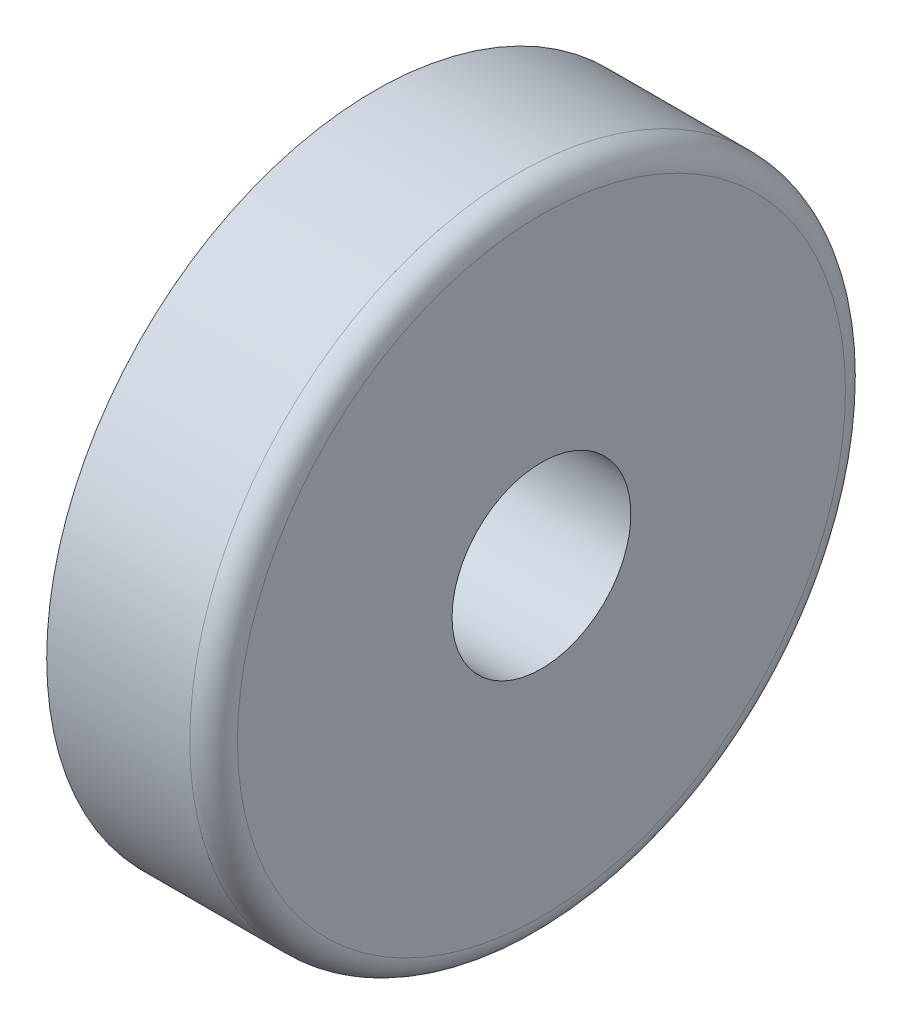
ISO-10303-21;
HEADER;
FILE_DESCRIPTION(('STEP AP214'),'2;1');
FILE_NAME('part.step','',(''),(''),'','','');
FILE_SCHEMA(('AUTOMOTIVE_DESIGN { 1 0 10303 214 1 1 1 1 }'));
ENDSEC;
DATA;
#1=APPLICATION_CONTEXT('core data for automotive mechanical design processes');
#2=APPLICATION_PROTOCOL_DEFINITION('international standard','automotive_design',2000,#1);
#3=PRODUCT_CONTEXT('',#1,'mechanical');
#4=PRODUCT('Part','Part','',(#3));
#5=PRODUCT_RELATED_PRODUCT_CATEGORY('part','',(#4));
#6=PRODUCT_DEFINITION_FORMATION('','',#4);
#7=PRODUCT_DEFINITION_CONTEXT('part definition',#1,'design');
#8=PRODUCT_DEFINITION('design','',#6,#7);
#9=PRODUCT_DEFINITION_SHAPE('','',#8);
#10=(LENGTH_UNIT() NAMED_UNIT(*) SI_UNIT(.MILLI.,.METRE.));
#11=(NAMED_UNIT(*) PLANE_ANGLE_UNIT() SI_UNIT($,.RADIAN.));
#12=(NAMED_UNIT(*) SI_UNIT($,.STERADIAN.) SOLID_ANGLE_UNIT());
#13=UNCERTAINTY_MEASURE_WITH_UNIT(LENGTH_MEASURE(1.E-05),#10,'distance_accuracy_value','');
#14=(GEOMETRIC_REPRESENTATION_CONTEXT(3) GLOBAL_UNCERTAINTY_ASSIGNED_CONTEXT((#13)) GLOBAL_UNIT_ASSIGNED_CONTEXT((#10,
#11,#12)) REPRESENTATION_CONTEXT('',''));
#15=CARTESIAN_POINT('',(0.,0.,0.));
#16=DIRECTION('',(0.,0.,1.));
#17=DIRECTION('',(1.,0.,0.));
#18=AXIS2_PLACEMENT_3D('',#15,#16,#17);
#19=CARTESIAN_POINT('',(-2.8,0.,-3.));
#20=DIRECTION('',(1.,0.,0.));
#21=DIRECTION('',(0.,0.,-1.));
#22=AXIS2_PLACEMENT_3D('',#19,#20,#21);
#23=PLANE('',#22);
#24=CARTESIAN_POINT('',(-2.8,0.,0.));
#25=DIRECTION('',(-1.,0.,0.));
#26=DIRECTION('',(0.,0.,1.));
#27=AXIS2_PLACEMENT_3D('',#24,#25,#26);
#28=CIRCLE('',#27,3.);
#29=CARTESIAN_POINT('',(-2.8,0.,3.));
#30=VERTEX_POINT('',#29);
#31=EDGE_CURVE('E10',#30,#30,#28,.T.);
#32=ORIENTED_EDGE('',*,*,#31,.F.);
#33=EDGE_LOOP('',(#32));
#34=FACE_BOUND('',#33,.T.);
#35=CARTESIAN_POINT('',(-2.8,0.,0.));
#36=DIRECTION('',(-1.,0.,0.));
#37=DIRECTION('',(0.,0.,1.));
#38=AXIS2_PLACEMENT_3D('',#35,#36,#37);
#39=CIRCLE('',#38,11.);
#40=CARTESIAN_POINT('',(-2.8,0.,11.));
#41=VERTEX_POINT('',#40);
#42=EDGE_CURVE('E52',#41,#41,#39,.T.);
#43=ORIENTED_EDGE('',*,*,#42,.T.);
#44=EDGE_LOOP('',(#43));
#45=FACE_BOUND('',#44,.T.);
#46=ADVANCED_FACE('F33',(#34,#45),#23,.F.);
#47=CARTESIAN_POINT('',(-6.56253366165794,0.,0.));
#48=DIRECTION('',(-1.,0.,0.));
#49=DIRECTION('',(0.,0.,1.));
#50=AXIS2_PLACEMENT_3D('',#47,#48,#49);
#51=CYLINDRICAL_SURFACE('',#50,3.);
#52=CARTESIAN_POINT('',(2.8,0.,0.));
#53=DIRECTION('',(-1.,0.,0.));
#54=DIRECTION('',(0.,0.,1.));
#55=AXIS2_PLACEMENT_3D('',#52,#53,#54);
#56=CIRCLE('',#55,3.);
#57=CARTESIAN_POINT('',(2.8,0.,3.));
#58=VERTEX_POINT('',#57);
#59=EDGE_CURVE('E39',#58,#58,#56,.T.);
#60=ORIENTED_EDGE('',*,*,#59,.F.);
#61=EDGE_LOOP('',(#60));
#62=FACE_BOUND('',#61,.T.);
#63=ORIENTED_EDGE('',*,*,#31,.T.);
#64=EDGE_LOOP('',(#63));
#65=FACE_BOUND('',#64,.T.);
#66=ADVANCED_FACE('F71',(#62,#65),#51,.F.);
#67=CARTESIAN_POINT('',(2.8,0.,-3.));
#68=DIRECTION('',(-1.,0.,0.));
#69=DIRECTION('',(0.,0.,1.));
#70=AXIS2_PLACEMENT_3D('',#67,#68,#69);
#71=PLANE('',#70);
#72=CARTESIAN_POINT('',(2.8,0.,0.));
#73=DIRECTION('',(-1.,0.,0.));
#74=DIRECTION('',(0.,0.,1.));
#75=AXIS2_PLACEMENT_3D('',#72,#73,#74);
#76=CIRCLE('',#75,10.2);
#77=CARTESIAN_POINT('',(2.8,0.,10.2));
#78=VERTEX_POINT('',#77);
#79=EDGE_CURVE('E43',#78,#78,#76,.T.);
#80=ORIENTED_EDGE('',*,*,#79,.F.);
#81=EDGE_LOOP('',(#80));
#82=FACE_BOUND('',#81,.T.);
#83=ORIENTED_EDGE('',*,*,#59,.T.);
#84=EDGE_LOOP('',(#83));
#85=FACE_BOUND('',#84,.T.);
#86=ADVANCED_FACE('F66',(#82,#85),#71,.F.);
#87=CARTESIAN_POINT('',(2.,0.,0.));
#88=DIRECTION('',(-1.,0.,0.));
#89=DIRECTION('',(0.,0.,1.));
#90=AXIS2_PLACEMENT_3D('',#87,#88,#89);
#91=TOROIDAL_SURFACE('',#90,10.2,0.8);
#92=CARTESIAN_POINT('',(1.99999999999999,0.,0.));
#93=DIRECTION('',(-1.,0.,0.));
#94=DIRECTION('',(0.,0.,1.));
#95=AXIS2_PLACEMENT_3D('',#92,#93,#94);
#96=CIRCLE('',#95,11.);
#97=CARTESIAN_POINT('',(1.99999999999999,0.,11.));
#98=VERTEX_POINT('',#97);
#99=EDGE_CURVE('E47',#98,#98,#96,.T.);
#100=ORIENTED_EDGE('',*,*,#99,.F.);
#101=EDGE_LOOP('',(#100));
#102=FACE_BOUND('',#101,.T.);
#103=ORIENTED_EDGE('',*,*,#79,.T.);
#104=EDGE_LOOP('',(#103));
#105=FACE_BOUND('',#104,.T.);
#106=ADVANCED_FACE('F60',(#102,#105),#91,.T.);
#107=CARTESIAN_POINT('',(-6.56253366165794,0.,0.));
#108=DIRECTION('',(-1.,0.,0.));
#109=DIRECTION('',(0.,0.,1.));
#110=AXIS2_PLACEMENT_3D('',#107,#108,#109);
#111=CYLINDRICAL_SURFACE('',#110,11.);
#112=ORIENTED_EDGE('',*,*,#42,.F.);
#113=EDGE_LOOP('',(#112));
#114=FACE_BOUND('',#113,.T.);
#115=ORIENTED_EDGE('',*,*,#99,.T.);
#116=EDGE_LOOP('',(#115));
#117=FACE_BOUND('',#116,.T.);
#118=ADVANCED_FACE('F57',(#114,#117),#111,.T.);
#119=CLOSED_SHELL('',(#46,#66,#86,#106,#118));
#120=MANIFOLD_SOLID_BREP('B2',#119);
#121=ADVANCED_BREP_SHAPE_REPRESENTATION('',(#18,#120),#14);
#122=SHAPE_DEFINITION_REPRESENTATION(#9,#121);
ENDSEC;
END-ISO-10303-21;
